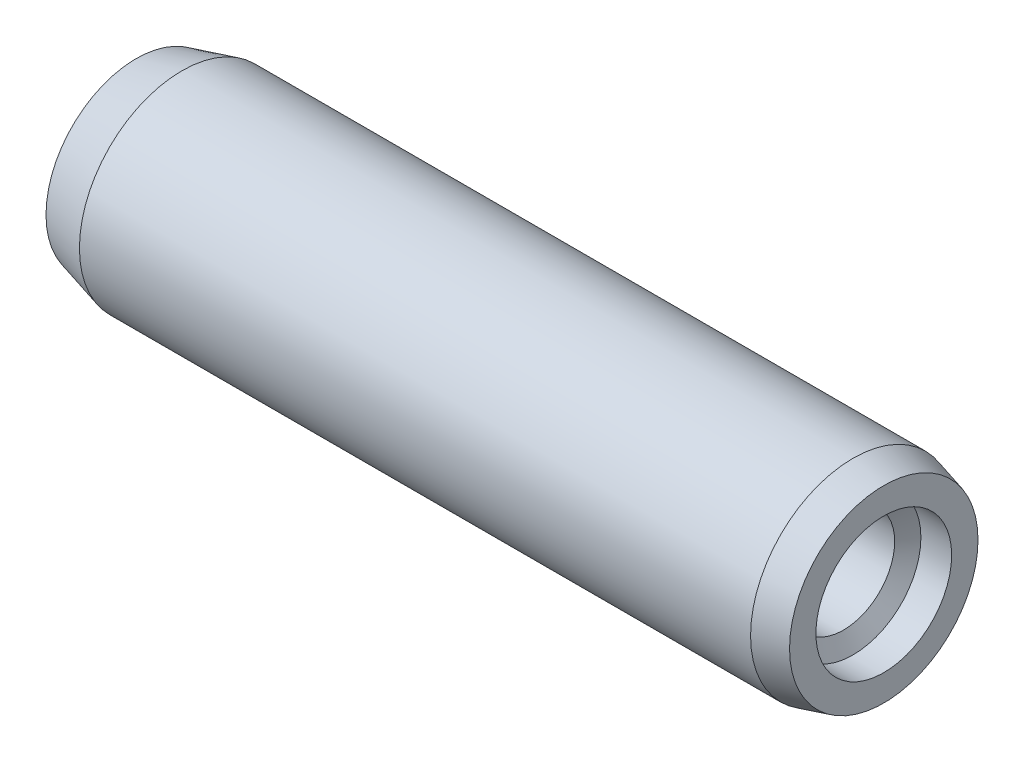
ISO-10303-21;
HEADER;
FILE_DESCRIPTION(('STEP AP214'),'2;1');
FILE_NAME('part.step','',(''),(''),'','','');
FILE_SCHEMA(('AUTOMOTIVE_DESIGN { 1 0 10303 214 1 1 1 1 }'));
ENDSEC;
DATA;
#1=APPLICATION_CONTEXT('core data for automotive mechanical design processes');
#2=APPLICATION_PROTOCOL_DEFINITION('international standard','automotive_design',2000,#1);
#3=PRODUCT_CONTEXT('',#1,'mechanical');
#4=PRODUCT('Part','Part','',(#3));
#5=PRODUCT_RELATED_PRODUCT_CATEGORY('part','',(#4));
#6=PRODUCT_DEFINITION_FORMATION('','',#4);
#7=PRODUCT_DEFINITION_CONTEXT('part definition',#1,'design');
#8=PRODUCT_DEFINITION('design','',#6,#7);
#9=PRODUCT_DEFINITION_SHAPE('','',#8);
#10=(LENGTH_UNIT() NAMED_UNIT(*) SI_UNIT(.MILLI.,.METRE.));
#11=(NAMED_UNIT(*) PLANE_ANGLE_UNIT() SI_UNIT($,.RADIAN.));
#12=(NAMED_UNIT(*) SI_UNIT($,.STERADIAN.) SOLID_ANGLE_UNIT());
#13=UNCERTAINTY_MEASURE_WITH_UNIT(LENGTH_MEASURE(1.E-05),#10,'distance_accuracy_value','');
#14=(GEOMETRIC_REPRESENTATION_CONTEXT(3) GLOBAL_UNCERTAINTY_ASSIGNED_CONTEXT((#13)) GLOBAL_UNIT_ASSIGNED_CONTEXT((#10,
#11,#12)) REPRESENTATION_CONTEXT('',''));
#15=CARTESIAN_POINT('',(0.,0.,0.));
#16=DIRECTION('',(0.,0.,1.));
#17=DIRECTION('',(1.,0.,0.));
#18=AXIS2_PLACEMENT_3D('',#15,#16,#17);
#19=CARTESIAN_POINT('',(8.,0.,0.));
#20=DIRECTION('',(0.,0.,1.00000000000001));
#21=DIRECTION('',(1.,0.,0.));
#22=AXIS2_PLACEMENT_3D('',#19,#20,#21);
#23=SPHERICAL_SURFACE('',#22,8.);
#24=CARTESIAN_POINT('',(8.,0.,0.));
#25=DIRECTION('',(-1.,0.,0.));
#26=DIRECTION('',(0.,0.,1.));
#27=AXIS2_PLACEMENT_3D('',#24,#25,#26);
#28=SPHERICAL_SURFACE('',#27,8.);
#29=CARTESIAN_POINT('',(0.817137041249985,0.,0.));
#30=DIRECTION('',(-1.,0.,0.));
#31=DIRECTION('',(0.,0.,1.00000000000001));
#32=AXIS2_PLACEMENT_3D('',#29,#30,#31);
#33=CIRCLE('',#32,3.52228330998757);
#34=CARTESIAN_POINT('',(0.817137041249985,0.,3.52228330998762));
#35=VERTEX_POINT('',#34);
#36=EDGE_CURVE('E60',#35,#35,#33,.T.);
#37=ORIENTED_EDGE('',*,*,#36,.T.);
#38=EDGE_LOOP('',(#37));
#39=FACE_BOUND('',#38,.T.);
#40=ADVANCED_FACE('F40',(#39),#28,.T.);
#41=CARTESIAN_POINT('',(30.,3.67846096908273,3.33066907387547E-13));
#42=DIRECTION('',(-1.,0.,0.));
#43=DIRECTION('',(0.,0.,1.00000000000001));
#44=AXIS2_PLACEMENT_3D('',#41,#42,#43);
#45=PLANE('',#44);
#46=CARTESIAN_POINT('',(30.0000000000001,0.,1.66533453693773E-13));
#47=DIRECTION('',(1.,0.,0.));
#48=DIRECTION('',(0.,0.,-1.00000000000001));
#49=AXIS2_PLACEMENT_3D('',#46,#47,#48);
#50=CIRCLE('',#49,2.65);
#51=CARTESIAN_POINT('',(30.0000000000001,0.,-2.64999999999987));
#52=VERTEX_POINT('',#51);
#53=EDGE_CURVE('E66',#52,#52,#50,.T.);
#54=ORIENTED_EDGE('',*,*,#53,.F.);
#55=EDGE_LOOP('',(#54));
#56=FACE_BOUND('',#55,.T.);
#57=CARTESIAN_POINT('',(30.0000000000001,0.,1.66533453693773E-13));
#58=DIRECTION('',(-1.,0.,0.));
#59=DIRECTION('',(0.,0.,1.00000000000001));
#60=AXIS2_PLACEMENT_3D('',#57,#58,#59);
#61=CIRCLE('',#60,3.67846096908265);
#62=CARTESIAN_POINT('',(30.0000000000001,0.,3.67846096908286));
#63=VERTEX_POINT('',#62);
#64=EDGE_CURVE('E11',#63,#63,#61,.T.);
#65=ORIENTED_EDGE('',*,*,#64,.F.);
#66=EDGE_LOOP('',(#65));
#67=FACE_BOUND('',#66,.T.);
#68=ADVANCED_FACE('F80',(#56,#67),#45,.F.);
#69=CARTESIAN_POINT('',(30.0000000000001,0.,1.66533453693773E-13));
#70=DIRECTION('',(-1.,0.,0.));
#71=DIRECTION('',(0.,0.,1.00000000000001));
#72=AXIS2_PLACEMENT_3D('',#69,#70,#71);
#73=CONICAL_SURFACE('',#72,3.67846096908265,0.261799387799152);
#74=CARTESIAN_POINT('',(28.8000000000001,0.,1.66533453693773E-13));
#75=DIRECTION('',(-1.,0.,0.));
#76=DIRECTION('',(0.,0.,1.00000000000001));
#77=AXIS2_PLACEMENT_3D('',#74,#75,#76);
#78=CIRCLE('',#77,4.);
#79=CARTESIAN_POINT('',(28.8000000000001,0.,4.00000000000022));
#80=VERTEX_POINT('',#79);
#81=EDGE_CURVE('E47',#80,#80,#78,.T.);
#82=ORIENTED_EDGE('',*,*,#81,.F.);
#83=EDGE_LOOP('',(#82));
#84=FACE_BOUND('',#83,.T.);
#85=ORIENTED_EDGE('',*,*,#64,.T.);
#86=EDGE_LOOP('',(#85));
#87=FACE_BOUND('',#86,.T.);
#88=ADVANCED_FACE('F77',(#84,#87),#73,.T.);
#89=CARTESIAN_POINT('',(-7.06251541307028,0.,2.22044604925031E-13));
#90=DIRECTION('',(-1.,0.,0.));
#91=DIRECTION('',(0.,0.,1.00000000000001));
#92=AXIS2_PLACEMENT_3D('',#89,#90,#91);
#93=CYLINDRICAL_SURFACE('',#92,4.);
#94=CARTESIAN_POINT('',(2.6,0.,0.));
#95=DIRECTION('',(-1.,0.,0.));
#96=DIRECTION('',(0.,0.,1.00000000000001));
#97=AXIS2_PLACEMENT_3D('',#94,#95,#96);
#98=CIRCLE('',#97,4.);
#99=CARTESIAN_POINT('',(2.6,0.,4.00000000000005));
#100=VERTEX_POINT('',#99);
#101=EDGE_CURVE('E63',#100,#100,#98,.T.);
#102=ORIENTED_EDGE('',*,*,#101,.F.);
#103=EDGE_LOOP('',(#102));
#104=FACE_BOUND('',#103,.T.);
#105=ORIENTED_EDGE('',*,*,#81,.T.);
#106=EDGE_LOOP('',(#105));
#107=FACE_BOUND('',#106,.T.);
#108=ADVANCED_FACE('F75',(#104,#107),#93,.T.);
#109=CARTESIAN_POINT('',(2.6,0.,0.));
#110=DIRECTION('',(1.,0.,0.));
#111=DIRECTION('',(0.,0.,-1.00000000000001));
#112=AXIS2_PLACEMENT_3D('',#109,#110,#111);
#113=CONICAL_SURFACE('',#112,4.,0.26179938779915);
#114=ORIENTED_EDGE('',*,*,#36,.F.);
#115=EDGE_LOOP('',(#114));
#116=FACE_BOUND('',#115,.T.);
#117=ORIENTED_EDGE('',*,*,#101,.T.);
#118=EDGE_LOOP('',(#117));
#119=FACE_BOUND('',#118,.T.);
#120=ADVANCED_FACE('F94',(#116,#119),#113,.T.);
#121=CARTESIAN_POINT('',(28.8000000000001,0.,1.66533453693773E-13));
#122=DIRECTION('',(1.,0.,0.));
#123=DIRECTION('',(0.,0.,-1.00000000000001));
#124=AXIS2_PLACEMENT_3D('',#121,#122,#123);
#125=CONICAL_SURFACE('',#124,2.65,1.0471975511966);
#126=CARTESIAN_POINT('',(28.8000000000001,0.,1.66533453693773E-13));
#127=DIRECTION('',(1.,0.,0.));
#128=DIRECTION('',(0.,0.,-1.00000000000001));
#129=AXIS2_PLACEMENT_3D('',#126,#127,#128);
#130=CIRCLE('',#129,2.65);
#131=CARTESIAN_POINT('',(28.8000000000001,0.,-2.64999999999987));
#132=VERTEX_POINT('',#131);
#133=EDGE_CURVE('E113',#132,#132,#130,.T.);
#134=ORIENTED_EDGE('',*,*,#133,.T.);
#135=EDGE_LOOP('',(#134));
#136=FACE_BOUND('',#135,.T.);
#137=CARTESIAN_POINT('',(28.4247223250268,0.,1.66533453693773E-13));
#138=DIRECTION('',(1.,0.,0.));
#139=DIRECTION('',(0.,0.,-1.00000000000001));
#140=AXIS2_PLACEMENT_3D('',#137,#138,#139);
#141=CIRCLE('',#140,2.);
#142=CARTESIAN_POINT('',(28.4247223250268,0.,-1.99999999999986));
#143=VERTEX_POINT('',#142);
#144=EDGE_CURVE('E43',#143,#143,#141,.T.);
#145=ORIENTED_EDGE('',*,*,#144,.F.);
#146=EDGE_LOOP('',(#145));
#147=FACE_BOUND('',#146,.T.);
#148=ADVANCED_FACE('F97',(#136,#147),#125,.F.);
#149=CARTESIAN_POINT('',(30.0000000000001,0.,1.66533453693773E-13));
#150=DIRECTION('',(1.,0.,0.));
#151=DIRECTION('',(0.,0.,-1.00000000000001));
#152=AXIS2_PLACEMENT_3D('',#149,#150,#151);
#153=CYLINDRICAL_SURFACE('',#152,2.65);
#154=ORIENTED_EDGE('',*,*,#133,.F.);
#155=EDGE_LOOP('',(#154));
#156=FACE_BOUND('',#155,.T.);
#157=ORIENTED_EDGE('',*,*,#53,.T.);
#158=EDGE_LOOP('',(#157));
#159=FACE_BOUND('',#158,.T.);
#160=ADVANCED_FACE('F54',(#156,#159),#153,.F.);
#161=CARTESIAN_POINT('',(18.,0.,1.66533453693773E-13));
#162=DIRECTION('',(1.,0.,0.));
#163=DIRECTION('',(0.,0.,-1.00000000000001));
#164=AXIS2_PLACEMENT_3D('',#161,#162,#163);
#165=CONICAL_SURFACE('',#164,2.,1.0471975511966);
#166=CARTESIAN_POINT('',(16.8452994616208,0.,0.));
#167=VERTEX_POINT('',#166);
#168=VERTEX_LOOP('',#167);
#169=FACE_BOUND('',#168,.T.);
#170=CARTESIAN_POINT('',(18.,0.,1.66533453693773E-13));
#171=DIRECTION('',(1.,0.,0.));
#172=DIRECTION('',(0.,0.,-1.00000000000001));
#173=AXIS2_PLACEMENT_3D('',#170,#171,#172);
#174=CIRCLE('',#173,2.);
#175=CARTESIAN_POINT('',(18.,0.,-1.99999999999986));
#176=VERTEX_POINT('',#175);
#177=EDGE_CURVE('E58',#176,#176,#174,.T.);
#178=ORIENTED_EDGE('',*,*,#177,.T.);
#179=EDGE_LOOP('',(#178));
#180=FACE_BOUND('',#179,.T.);
#181=ADVANCED_FACE('F50',(#169,#180),#165,.F.);
#182=CARTESIAN_POINT('',(30.0000000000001,0.,1.66533453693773E-13));
#183=DIRECTION('',(1.,0.,0.));
#184=DIRECTION('',(0.,0.,-1.00000000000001));
#185=AXIS2_PLACEMENT_3D('',#182,#183,#184);
#186=CYLINDRICAL_SURFACE('',#185,2.);
#187=ORIENTED_EDGE('',*,*,#144,.T.);
#188=EDGE_LOOP('',(#187));
#189=FACE_BOUND('',#188,.T.);
#190=ORIENTED_EDGE('',*,*,#177,.F.);
#191=EDGE_LOOP('',(#190));
#192=FACE_BOUND('',#191,.T.);
#193=ADVANCED_FACE('F53',(#189,#192),#186,.F.);
#194=CLOSED_SHELL('',(#40,#68,#88,#108,#120,#148,#160,#181,#193));
#195=MANIFOLD_SOLID_BREP('B2',#194);
#196=ADVANCED_BREP_SHAPE_REPRESENTATION('',(#18,#195),#14);
#197=SHAPE_DEFINITION_REPRESENTATION(#9,#196);
ENDSEC;
END-ISO-10303-21;
